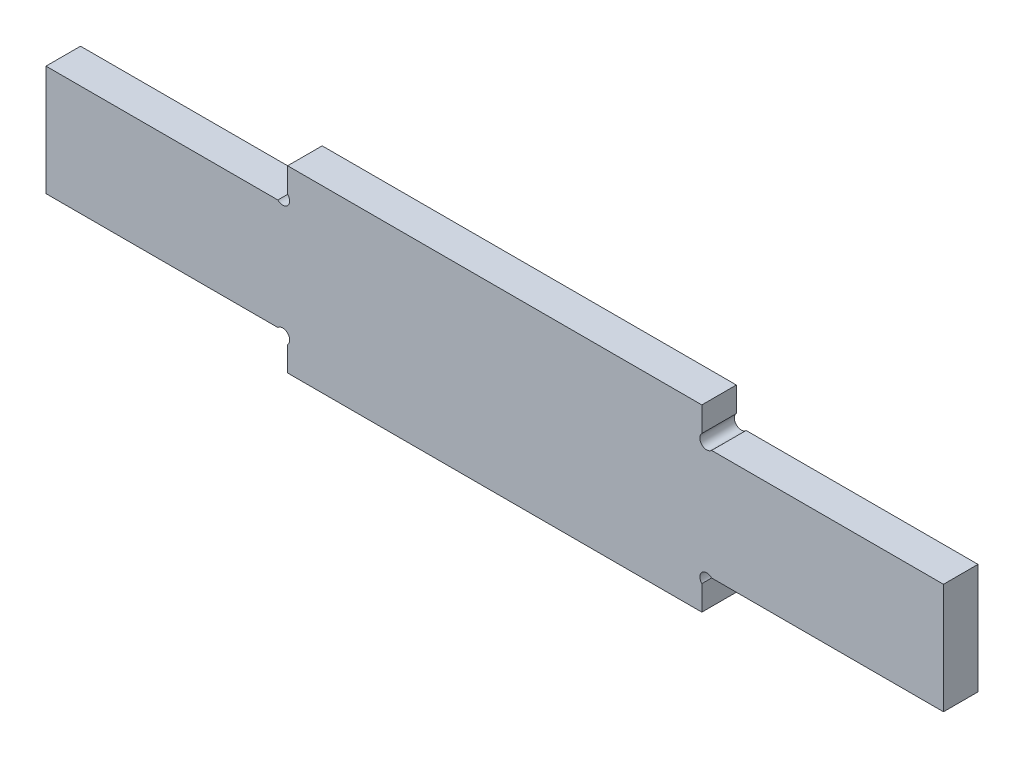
ISO-10303-21;
HEADER;
FILE_DESCRIPTION(('STEP AP214'),'2;1');
FILE_NAME('part.step','',(''),(''),'','','');
FILE_SCHEMA(('AUTOMOTIVE_DESIGN { 1 0 10303 214 1 1 1 1 }'));
ENDSEC;
DATA;
#1=APPLICATION_CONTEXT('core data for automotive mechanical design processes');
#2=APPLICATION_PROTOCOL_DEFINITION('international standard','automotive_design',2000,#1);
#3=PRODUCT_CONTEXT('',#1,'mechanical');
#4=PRODUCT('Part','Part','',(#3));
#5=PRODUCT_RELATED_PRODUCT_CATEGORY('part','',(#4));
#6=PRODUCT_DEFINITION_FORMATION('','',#4);
#7=PRODUCT_DEFINITION_CONTEXT('part definition',#1,'design');
#8=PRODUCT_DEFINITION('design','',#6,#7);
#9=PRODUCT_DEFINITION_SHAPE('','',#8);
#10=(LENGTH_UNIT() NAMED_UNIT(*) SI_UNIT(.MILLI.,.METRE.));
#11=(NAMED_UNIT(*) PLANE_ANGLE_UNIT() SI_UNIT($,.RADIAN.));
#12=(NAMED_UNIT(*) SI_UNIT($,.STERADIAN.) SOLID_ANGLE_UNIT());
#13=UNCERTAINTY_MEASURE_WITH_UNIT(LENGTH_MEASURE(1.E-05),#10,'distance_accuracy_value','');
#14=(GEOMETRIC_REPRESENTATION_CONTEXT(3) GLOBAL_UNCERTAINTY_ASSIGNED_CONTEXT((#13)) GLOBAL_UNIT_ASSIGNED_CONTEXT((#10,
#11,#12)) REPRESENTATION_CONTEXT('',''));
#15=CARTESIAN_POINT('',(0.,0.,0.));
#16=DIRECTION('',(0.,0.,1.));
#17=DIRECTION('',(1.,0.,0.));
#18=AXIS2_PLACEMENT_3D('',#15,#16,#17);
#19=CARTESIAN_POINT('',(0.,26.,5.));
#20=DIRECTION('',(0.,0.,-1.));
#21=DIRECTION('',(-1.,0.,0.));
#22=AXIS2_PLACEMENT_3D('',#19,#20,#21);
#23=PLANE('',#22);
#24=DIRECTION('',(0.,1.,0.));
#25=VECTOR('',#24,1.);
#26=CARTESIAN_POINT('',(95.,0.,5.));
#27=LINE('',#26,#25);
#28=CARTESIAN_POINT('',(95.,0.,5.));
#29=VERTEX_POINT('',#28);
#30=CARTESIAN_POINT('',(95.,3.5857864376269,5.));
#31=VERTEX_POINT('',#30);
#32=EDGE_CURVE('E54',#29,#31,#27,.T.);
#33=ORIENTED_EDGE('',*,*,#32,.T.);
#34=CARTESIAN_POINT('',(95.7071067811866,4.29289321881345,5.));
#35=DIRECTION('',(0.,0.,-1.));
#36=DIRECTION('',(-1.,0.,0.));
#37=AXIS2_PLACEMENT_3D('',#34,#35,#36);
#38=CIRCLE('',#37,0.999999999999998);
#39=CARTESIAN_POINT('',(96.4142135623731,5.,5.));
#40=VERTEX_POINT('',#39);
#41=EDGE_CURVE('E165',#31,#40,#38,.T.);
#42=ORIENTED_EDGE('',*,*,#41,.T.);
#43=DIRECTION('',(1.,0.,0.));
#44=VECTOR('',#43,1.);
#45=CARTESIAN_POINT('',(130.,5.,5.));
#46=LINE('',#45,#44);
#47=CARTESIAN_POINT('',(130.,5.,5.));
#48=VERTEX_POINT('',#47);
#49=EDGE_CURVE('E174',#40,#48,#46,.T.);
#50=ORIENTED_EDGE('',*,*,#49,.T.);
#51=DIRECTION('',(0.,-1.,0.));
#52=VECTOR('',#51,1.);
#53=CARTESIAN_POINT('',(130.,0.,5.));
#54=LINE('',#53,#52);
#55=CARTESIAN_POINT('',(130.,21.,5.));
#56=VERTEX_POINT('',#55);
#57=EDGE_CURVE('E202',#56,#48,#54,.T.);
#58=ORIENTED_EDGE('',*,*,#57,.F.);
#59=DIRECTION('',(-1.,0.,0.));
#60=VECTOR('',#59,1.);
#61=CARTESIAN_POINT('',(130.,21.,5.));
#62=LINE('',#61,#60);
#63=CARTESIAN_POINT('',(96.4142135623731,21.,5.));
#64=VERTEX_POINT('',#63);
#65=EDGE_CURVE('E62',#56,#64,#62,.T.);
#66=ORIENTED_EDGE('',*,*,#65,.T.);
#67=CARTESIAN_POINT('',(95.7071067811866,21.7071067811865,5.));
#68=DIRECTION('',(0.,0.,-1.));
#69=DIRECTION('',(-1.,0.,0.));
#70=AXIS2_PLACEMENT_3D('',#67,#68,#69);
#71=CIRCLE('',#70,0.999999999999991);
#72=CARTESIAN_POINT('',(95.,22.4142135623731,5.));
#73=VERTEX_POINT('',#72);
#74=EDGE_CURVE('E178',#64,#73,#71,.T.);
#75=ORIENTED_EDGE('',*,*,#74,.T.);
#76=DIRECTION('',(0.,1.,0.));
#77=VECTOR('',#76,1.);
#78=CARTESIAN_POINT('',(95.,26.,5.));
#79=LINE('',#78,#77);
#80=CARTESIAN_POINT('',(95.,26.,5.));
#81=VERTEX_POINT('',#80);
#82=EDGE_CURVE('E193',#73,#81,#79,.T.);
#83=ORIENTED_EDGE('',*,*,#82,.T.);
#84=DIRECTION('',(-1.,0.,0.));
#85=VECTOR('',#84,1.);
#86=CARTESIAN_POINT('',(0.,26.,5.));
#87=LINE('',#86,#85);
#88=CARTESIAN_POINT('',(35.,26.,5.));
#89=VERTEX_POINT('',#88);
#90=EDGE_CURVE('E11',#81,#89,#87,.T.);
#91=ORIENTED_EDGE('',*,*,#90,.T.);
#92=DIRECTION('',(0.,1.,0.));
#93=VECTOR('',#92,1.);
#94=CARTESIAN_POINT('',(35.,26.,5.));
#95=LINE('',#94,#93);
#96=CARTESIAN_POINT('',(35.,22.4142135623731,5.));
#97=VERTEX_POINT('',#96);
#98=EDGE_CURVE('E245',#97,#89,#95,.T.);
#99=ORIENTED_EDGE('',*,*,#98,.F.);
#100=CARTESIAN_POINT('',(34.2928932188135,21.7071067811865,5.));
#101=DIRECTION('',(0.,0.,1.));
#102=DIRECTION('',(1.,0.,0.));
#103=AXIS2_PLACEMENT_3D('',#100,#101,#102);
#104=CIRCLE('',#103,0.999999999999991);
#105=CARTESIAN_POINT('',(33.5857864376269,21.,5.));
#106=VERTEX_POINT('',#105);
#107=EDGE_CURVE('E220',#106,#97,#104,.T.);
#108=ORIENTED_EDGE('',*,*,#107,.F.);
#109=DIRECTION('',(1.,0.,0.));
#110=VECTOR('',#109,1.);
#111=CARTESIAN_POINT('',(0.,21.,5.));
#112=LINE('',#111,#110);
#113=CARTESIAN_POINT('',(0.,21.,5.));
#114=VERTEX_POINT('',#113);
#115=EDGE_CURVE('E242',#114,#106,#112,.T.);
#116=ORIENTED_EDGE('',*,*,#115,.F.);
#117=DIRECTION('',(0.,-1.,0.));
#118=VECTOR('',#117,1.);
#119=CARTESIAN_POINT('',(0.,0.,5.));
#120=LINE('',#119,#118);
#121=CARTESIAN_POINT('',(0.,5.,5.));
#122=VERTEX_POINT('',#121);
#123=EDGE_CURVE('E257',#114,#122,#120,.T.);
#124=ORIENTED_EDGE('',*,*,#123,.T.);
#125=DIRECTION('',(-1.,0.,0.));
#126=VECTOR('',#125,1.);
#127=CARTESIAN_POINT('',(0.,5.,5.));
#128=LINE('',#127,#126);
#129=CARTESIAN_POINT('',(33.5857864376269,5.,5.));
#130=VERTEX_POINT('',#129);
#131=EDGE_CURVE('E232',#130,#122,#128,.T.);
#132=ORIENTED_EDGE('',*,*,#131,.F.);
#133=CARTESIAN_POINT('',(34.2928932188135,4.29289321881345,5.));
#134=DIRECTION('',(0.,0.,1.));
#135=DIRECTION('',(1.,0.,0.));
#136=AXIS2_PLACEMENT_3D('',#133,#134,#135);
#137=CIRCLE('',#136,0.999999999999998);
#138=CARTESIAN_POINT('',(35.,3.58578643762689,5.));
#139=VERTEX_POINT('',#138);
#140=EDGE_CURVE('E214',#139,#130,#137,.T.);
#141=ORIENTED_EDGE('',*,*,#140,.F.);
#142=DIRECTION('',(0.,1.,0.));
#143=VECTOR('',#142,1.);
#144=CARTESIAN_POINT('',(35.,0.,5.));
#145=LINE('',#144,#143);
#146=CARTESIAN_POINT('',(35.,0.,5.));
#147=VERTEX_POINT('',#146);
#148=EDGE_CURVE('E229',#147,#139,#145,.T.);
#149=ORIENTED_EDGE('',*,*,#148,.F.);
#150=DIRECTION('',(1.,0.,0.));
#151=VECTOR('',#150,1.);
#152=CARTESIAN_POINT('',(0.,0.,5.));
#153=LINE('',#152,#151);
#154=EDGE_CURVE('E46',#147,#29,#153,.T.);
#155=ORIENTED_EDGE('',*,*,#154,.T.);
#156=EDGE_LOOP('',(#33,#42,#50,#58,#66,#75,#83,#91,#99,#108,#116,#124,#132,#141,#149,#155));
#157=FACE_BOUND('',#156,.T.);
#158=ADVANCED_FACE('F37',(#157),#23,.F.);
#159=CARTESIAN_POINT('',(0.,26.,0.));
#160=DIRECTION('',(0.,0.,-1.));
#161=DIRECTION('',(-1.,0.,0.));
#162=AXIS2_PLACEMENT_3D('',#159,#160,#161);
#163=PLANE('',#162);
#164=CARTESIAN_POINT('',(95.7071067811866,4.29289321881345,0.));
#165=DIRECTION('',(0.,0.,-1.));
#166=DIRECTION('',(-1.,0.,0.));
#167=AXIS2_PLACEMENT_3D('',#164,#165,#166);
#168=CIRCLE('',#167,0.999999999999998);
#169=CARTESIAN_POINT('',(95.,3.5857864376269,0.));
#170=VERTEX_POINT('',#169);
#171=CARTESIAN_POINT('',(96.4142135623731,5.,0.));
#172=VERTEX_POINT('',#171);
#173=EDGE_CURVE('E153',#170,#172,#168,.T.);
#174=ORIENTED_EDGE('',*,*,#173,.F.);
#175=DIRECTION('',(0.,1.,0.));
#176=VECTOR('',#175,1.);
#177=CARTESIAN_POINT('',(95.,0.,0.));
#178=LINE('',#177,#176);
#179=CARTESIAN_POINT('',(95.,0.,0.));
#180=VERTEX_POINT('',#179);
#181=EDGE_CURVE('E158',#180,#170,#178,.T.);
#182=ORIENTED_EDGE('',*,*,#181,.F.);
#183=DIRECTION('',(1.,0.,0.));
#184=VECTOR('',#183,1.);
#185=CARTESIAN_POINT('',(0.,0.,0.));
#186=LINE('',#185,#184);
#187=CARTESIAN_POINT('',(35.,0.,0.));
#188=VERTEX_POINT('',#187);
#189=EDGE_CURVE('E263',#188,#180,#186,.T.);
#190=ORIENTED_EDGE('',*,*,#189,.F.);
#191=DIRECTION('',(0.,1.,0.));
#192=VECTOR('',#191,1.);
#193=CARTESIAN_POINT('',(35.,0.,0.));
#194=LINE('',#193,#192);
#195=CARTESIAN_POINT('',(35.,3.58578643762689,0.));
#196=VERTEX_POINT('',#195);
#197=EDGE_CURVE('E224',#188,#196,#194,.T.);
#198=ORIENTED_EDGE('',*,*,#197,.T.);
#199=CARTESIAN_POINT('',(34.2928932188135,4.29289321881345,0.));
#200=DIRECTION('',(0.,0.,-1.));
#201=DIRECTION('',(-1.,0.,0.));
#202=AXIS2_PLACEMENT_3D('',#199,#200,#201);
#203=CIRCLE('',#202,0.999999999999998);
#204=CARTESIAN_POINT('',(33.5857864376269,5.,0.));
#205=VERTEX_POINT('',#204);
#206=EDGE_CURVE('E216',#196,#205,#203,.F.);
#207=ORIENTED_EDGE('',*,*,#206,.T.);
#208=DIRECTION('',(-1.,0.,0.));
#209=VECTOR('',#208,1.);
#210=CARTESIAN_POINT('',(0.,5.,0.));
#211=LINE('',#210,#209);
#212=CARTESIAN_POINT('',(0.,5.,0.));
#213=VERTEX_POINT('',#212);
#214=EDGE_CURVE('E227',#205,#213,#211,.T.);
#215=ORIENTED_EDGE('',*,*,#214,.T.);
#216=DIRECTION('',(0.,-1.,0.));
#217=VECTOR('',#216,1.);
#218=CARTESIAN_POINT('',(0.,0.,0.));
#219=LINE('',#218,#217);
#220=CARTESIAN_POINT('',(0.,21.,0.));
#221=VERTEX_POINT('',#220);
#222=EDGE_CURVE('E256',#221,#213,#219,.T.);
#223=ORIENTED_EDGE('',*,*,#222,.F.);
#224=DIRECTION('',(1.,0.,0.));
#225=VECTOR('',#224,1.);
#226=CARTESIAN_POINT('',(0.,21.,0.));
#227=LINE('',#226,#225);
#228=CARTESIAN_POINT('',(33.5857864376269,21.,0.));
#229=VERTEX_POINT('',#228);
#230=EDGE_CURVE('E252',#221,#229,#227,.T.);
#231=ORIENTED_EDGE('',*,*,#230,.T.);
#232=CARTESIAN_POINT('',(34.2928932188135,21.7071067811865,0.));
#233=DIRECTION('',(0.,0.,-1.));
#234=DIRECTION('',(-1.,0.,0.));
#235=AXIS2_PLACEMENT_3D('',#232,#233,#234);
#236=CIRCLE('',#235,0.999999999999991);
#237=CARTESIAN_POINT('',(35.,22.4142135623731,0.));
#238=VERTEX_POINT('',#237);
#239=EDGE_CURVE('E222',#229,#238,#236,.F.);
#240=ORIENTED_EDGE('',*,*,#239,.T.);
#241=DIRECTION('',(0.,1.,0.));
#242=VECTOR('',#241,1.);
#243=CARTESIAN_POINT('',(35.,26.,0.));
#244=LINE('',#243,#242);
#245=CARTESIAN_POINT('',(35.,26.,0.));
#246=VERTEX_POINT('',#245);
#247=EDGE_CURVE('E238',#238,#246,#244,.T.);
#248=ORIENTED_EDGE('',*,*,#247,.T.);
#249=DIRECTION('',(-1.,0.,0.));
#250=VECTOR('',#249,1.);
#251=CARTESIAN_POINT('',(0.,26.,0.));
#252=LINE('',#251,#250);
#253=CARTESIAN_POINT('',(95.,26.,0.));
#254=VERTEX_POINT('',#253);
#255=EDGE_CURVE('E41',#254,#246,#252,.T.);
#256=ORIENTED_EDGE('',*,*,#255,.F.);
#257=DIRECTION('',(0.,1.,0.));
#258=VECTOR('',#257,1.);
#259=CARTESIAN_POINT('',(95.,26.,0.));
#260=LINE('',#259,#258);
#261=CARTESIAN_POINT('',(95.,22.4142135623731,0.));
#262=VERTEX_POINT('',#261);
#263=EDGE_CURVE('E188',#262,#254,#260,.T.);
#264=ORIENTED_EDGE('',*,*,#263,.F.);
#265=CARTESIAN_POINT('',(95.7071067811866,21.7071067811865,0.));
#266=DIRECTION('',(0.,0.,-1.));
#267=DIRECTION('',(-1.,0.,0.));
#268=AXIS2_PLACEMENT_3D('',#265,#266,#267);
#269=CIRCLE('',#268,0.999999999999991);
#270=CARTESIAN_POINT('',(96.4142135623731,21.,0.));
#271=VERTEX_POINT('',#270);
#272=EDGE_CURVE('E175',#271,#262,#269,.T.);
#273=ORIENTED_EDGE('',*,*,#272,.F.);
#274=DIRECTION('',(-1.,0.,0.));
#275=VECTOR('',#274,1.);
#276=CARTESIAN_POINT('',(130.,21.,0.));
#277=LINE('',#276,#275);
#278=CARTESIAN_POINT('',(130.,21.,0.));
#279=VERTEX_POINT('',#278);
#280=EDGE_CURVE('E190',#279,#271,#277,.T.);
#281=ORIENTED_EDGE('',*,*,#280,.F.);
#282=DIRECTION('',(0.,-1.,0.));
#283=VECTOR('',#282,1.);
#284=CARTESIAN_POINT('',(130.,0.,0.));
#285=LINE('',#284,#283);
#286=CARTESIAN_POINT('',(130.,5.,0.));
#287=VERTEX_POINT('',#286);
#288=EDGE_CURVE('E199',#279,#287,#285,.T.);
#289=ORIENTED_EDGE('',*,*,#288,.T.);
#290=DIRECTION('',(1.,0.,0.));
#291=VECTOR('',#290,1.);
#292=CARTESIAN_POINT('',(130.,5.,0.));
#293=LINE('',#292,#291);
#294=EDGE_CURVE('E161',#172,#287,#293,.T.);
#295=ORIENTED_EDGE('',*,*,#294,.F.);
#296=EDGE_LOOP('',(#174,#182,#190,#198,#207,#215,#223,#231,#240,#248,#256,#264,#273,#281,#289,#295));
#297=FACE_BOUND('',#296,.T.);
#298=ADVANCED_FACE('F155',(#297),#163,.T.);
#299=CARTESIAN_POINT('',(95.,0.,-0.00100000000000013));
#300=DIRECTION('',(1.,0.,0.));
#301=DIRECTION('',(0.,0.,-1.));
#302=AXIS2_PLACEMENT_3D('',#299,#300,#301);
#303=PLANE('',#302);
#304=ORIENTED_EDGE('',*,*,#181,.T.);
#305=DIRECTION('',(0.,0.,1.));
#306=VECTOR('',#305,1.);
#307=CARTESIAN_POINT('',(95.,3.5857864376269,-0.00100000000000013));
#308=LINE('',#307,#306);
#309=EDGE_CURVE('E167',#31,#170,#308,.F.);
#310=ORIENTED_EDGE('',*,*,#309,.F.);
#311=ORIENTED_EDGE('',*,*,#32,.F.);
#312=DIRECTION('',(0.,0.,1.));
#313=VECTOR('',#312,1.);
#314=CARTESIAN_POINT('',(95.,0.,-0.00100000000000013));
#315=LINE('',#314,#313);
#316=EDGE_CURVE('E173',#180,#29,#315,.T.);
#317=ORIENTED_EDGE('',*,*,#316,.F.);
#318=EDGE_LOOP('',(#304,#310,#311,#317));
#319=FACE_BOUND('',#318,.T.);
#320=ADVANCED_FACE('F172',(#319),#303,.T.);
#321=CARTESIAN_POINT('',(130.,21.,-0.00100000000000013));
#322=DIRECTION('',(0.,1.,0.));
#323=DIRECTION('',(0.,0.,1.));
#324=AXIS2_PLACEMENT_3D('',#321,#322,#323);
#325=PLANE('',#324);
#326=ORIENTED_EDGE('',*,*,#280,.T.);
#327=DIRECTION('',(0.,0.,1.));
#328=VECTOR('',#327,1.);
#329=CARTESIAN_POINT('',(96.4142135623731,21.,-0.00100000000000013));
#330=LINE('',#329,#328);
#331=EDGE_CURVE('E170',#64,#271,#330,.F.);
#332=ORIENTED_EDGE('',*,*,#331,.F.);
#333=ORIENTED_EDGE('',*,*,#65,.F.);
#334=DIRECTION('',(0.,0.,1.));
#335=VECTOR('',#334,1.);
#336=CARTESIAN_POINT('',(130.,21.,-0.00100000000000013));
#337=LINE('',#336,#335);
#338=EDGE_CURVE('E197',#279,#56,#337,.T.);
#339=ORIENTED_EDGE('',*,*,#338,.F.);
#340=EDGE_LOOP('',(#326,#332,#333,#339));
#341=FACE_BOUND('',#340,.T.);
#342=ADVANCED_FACE('F293',(#341),#325,.T.);
#343=CARTESIAN_POINT('',(130.,5.,-0.00100000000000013));
#344=DIRECTION('',(0.,-1.,0.));
#345=DIRECTION('',(0.,0.,-1.));
#346=AXIS2_PLACEMENT_3D('',#343,#344,#345);
#347=PLANE('',#346);
#348=ORIENTED_EDGE('',*,*,#49,.F.);
#349=DIRECTION('',(0.,0.,1.));
#350=VECTOR('',#349,1.);
#351=CARTESIAN_POINT('',(96.4142135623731,5.,-0.00100000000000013));
#352=LINE('',#351,#350);
#353=EDGE_CURVE('E291',#172,#40,#352,.T.);
#354=ORIENTED_EDGE('',*,*,#353,.F.);
#355=ORIENTED_EDGE('',*,*,#294,.T.);
#356=DIRECTION('',(0.,0.,1.));
#357=VECTOR('',#356,1.);
#358=CARTESIAN_POINT('',(130.,5.,-0.00100000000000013));
#359=LINE('',#358,#357);
#360=EDGE_CURVE('E183',#287,#48,#359,.T.);
#361=ORIENTED_EDGE('',*,*,#360,.T.);
#362=EDGE_LOOP('',(#348,#354,#355,#361));
#363=FACE_BOUND('',#362,.T.);
#364=ADVANCED_FACE('F300',(#363),#347,.T.);
#365=CARTESIAN_POINT('',(95.,26.,-0.00100000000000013));
#366=DIRECTION('',(1.,0.,0.));
#367=DIRECTION('',(0.,0.,-1.));
#368=AXIS2_PLACEMENT_3D('',#365,#366,#367);
#369=PLANE('',#368);
#370=ORIENTED_EDGE('',*,*,#82,.F.);
#371=DIRECTION('',(0.,0.,1.));
#372=VECTOR('',#371,1.);
#373=CARTESIAN_POINT('',(95.,22.4142135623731,-0.00100000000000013));
#374=LINE('',#373,#372);
#375=EDGE_CURVE('E164',#262,#73,#374,.T.);
#376=ORIENTED_EDGE('',*,*,#375,.F.);
#377=ORIENTED_EDGE('',*,*,#263,.T.);
#378=DIRECTION('',(0.,0.,1.));
#379=VECTOR('',#378,1.);
#380=CARTESIAN_POINT('',(95.,26.,-0.00100000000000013));
#381=LINE('',#380,#379);
#382=EDGE_CURVE('E196',#254,#81,#381,.T.);
#383=ORIENTED_EDGE('',*,*,#382,.T.);
#384=EDGE_LOOP('',(#370,#376,#377,#383));
#385=FACE_BOUND('',#384,.T.);
#386=ADVANCED_FACE('F285',(#385),#369,.T.);
#387=CARTESIAN_POINT('',(130.,0.,5.));
#388=DIRECTION('',(1.,0.,0.));
#389=DIRECTION('',(0.,0.,-1.));
#390=AXIS2_PLACEMENT_3D('',#387,#388,#389);
#391=PLANE('',#390);
#392=ORIENTED_EDGE('',*,*,#57,.T.);
#393=ORIENTED_EDGE('',*,*,#360,.F.);
#394=ORIENTED_EDGE('',*,*,#288,.F.);
#395=ORIENTED_EDGE('',*,*,#338,.T.);
#396=EDGE_LOOP('',(#392,#393,#394,#395));
#397=FACE_BOUND('',#396,.T.);
#398=ADVANCED_FACE('F296',(#397),#391,.T.);
#399=CARTESIAN_POINT('',(0.,0.,5.));
#400=DIRECTION('',(0.,1.,0.));
#401=DIRECTION('',(0.,0.,1.));
#402=AXIS2_PLACEMENT_3D('',#399,#400,#401);
#403=PLANE('',#402);
#404=ORIENTED_EDGE('',*,*,#316,.T.);
#405=ORIENTED_EDGE('',*,*,#154,.F.);
#406=DIRECTION('',(0.,0.,1.));
#407=VECTOR('',#406,1.);
#408=CARTESIAN_POINT('',(35.,0.,-0.00100000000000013));
#409=LINE('',#408,#407);
#410=EDGE_CURVE('E234',#188,#147,#409,.T.);
#411=ORIENTED_EDGE('',*,*,#410,.F.);
#412=ORIENTED_EDGE('',*,*,#189,.T.);
#413=EDGE_LOOP('',(#404,#405,#411,#412));
#414=FACE_BOUND('',#413,.T.);
#415=ADVANCED_FACE('F324',(#414),#403,.F.);
#416=CARTESIAN_POINT('',(0.,26.,5.));
#417=DIRECTION('',(0.,-1.,0.));
#418=DIRECTION('',(0.,0.,-1.));
#419=AXIS2_PLACEMENT_3D('',#416,#417,#418);
#420=PLANE('',#419);
#421=ORIENTED_EDGE('',*,*,#382,.F.);
#422=ORIENTED_EDGE('',*,*,#255,.T.);
#423=DIRECTION('',(0.,0.,1.));
#424=VECTOR('',#423,1.);
#425=CARTESIAN_POINT('',(35.,26.,-0.00100000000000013));
#426=LINE('',#425,#424);
#427=EDGE_CURVE('E249',#246,#89,#426,.T.);
#428=ORIENTED_EDGE('',*,*,#427,.T.);
#429=ORIENTED_EDGE('',*,*,#90,.F.);
#430=EDGE_LOOP('',(#421,#422,#428,#429));
#431=FACE_BOUND('',#430,.T.);
#432=ADVANCED_FACE('F269',(#431),#420,.F.);
#433=CARTESIAN_POINT('',(0.,0.,5.));
#434=DIRECTION('',(1.,0.,0.));
#435=DIRECTION('',(0.,0.,-1.));
#436=AXIS2_PLACEMENT_3D('',#433,#434,#435);
#437=PLANE('',#436);
#438=ORIENTED_EDGE('',*,*,#222,.T.);
#439=DIRECTION('',(0.,0.,1.));
#440=VECTOR('',#439,1.);
#441=CARTESIAN_POINT('',(0.,5.,-0.00100000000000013));
#442=LINE('',#441,#440);
#443=EDGE_CURVE('E235',#213,#122,#442,.T.);
#444=ORIENTED_EDGE('',*,*,#443,.T.);
#445=ORIENTED_EDGE('',*,*,#123,.F.);
#446=DIRECTION('',(0.,0.,1.));
#447=VECTOR('',#446,1.);
#448=CARTESIAN_POINT('',(0.,21.,-0.00100000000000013));
#449=LINE('',#448,#447);
#450=EDGE_CURVE('E248',#221,#114,#449,.T.);
#451=ORIENTED_EDGE('',*,*,#450,.F.);
#452=EDGE_LOOP('',(#438,#444,#445,#451));
#453=FACE_BOUND('',#452,.T.);
#454=ADVANCED_FACE('F39',(#453),#437,.F.);
#455=CARTESIAN_POINT('',(35.,26.,-0.00100000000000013));
#456=DIRECTION('',(1.,0.,0.));
#457=DIRECTION('',(0.,0.,-1.));
#458=AXIS2_PLACEMENT_3D('',#455,#456,#457);
#459=PLANE('',#458);
#460=ORIENTED_EDGE('',*,*,#247,.F.);
#461=DIRECTION('',(0.,0.,1.));
#462=VECTOR('',#461,1.);
#463=CARTESIAN_POINT('',(35.,22.4142135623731,-0.00100000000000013));
#464=LINE('',#463,#462);
#465=EDGE_CURVE('E209',#97,#238,#464,.F.);
#466=ORIENTED_EDGE('',*,*,#465,.F.);
#467=ORIENTED_EDGE('',*,*,#98,.T.);
#468=ORIENTED_EDGE('',*,*,#427,.F.);
#469=EDGE_LOOP('',(#460,#466,#467,#468));
#470=FACE_BOUND('',#469,.T.);
#471=ADVANCED_FACE('F276',(#470),#459,.F.);
#472=CARTESIAN_POINT('',(0.,21.,-0.00100000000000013));
#473=DIRECTION('',(0.,-1.,0.));
#474=DIRECTION('',(0.,0.,-1.));
#475=AXIS2_PLACEMENT_3D('',#472,#473,#474);
#476=PLANE('',#475);
#477=ORIENTED_EDGE('',*,*,#115,.T.);
#478=DIRECTION('',(0.,0.,1.));
#479=VECTOR('',#478,1.);
#480=CARTESIAN_POINT('',(33.5857864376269,21.,-0.00100000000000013));
#481=LINE('',#480,#479);
#482=EDGE_CURVE('E218',#229,#106,#481,.T.);
#483=ORIENTED_EDGE('',*,*,#482,.F.);
#484=ORIENTED_EDGE('',*,*,#230,.F.);
#485=ORIENTED_EDGE('',*,*,#450,.T.);
#486=EDGE_LOOP('',(#477,#483,#484,#485));
#487=FACE_BOUND('',#486,.T.);
#488=ADVANCED_FACE('F320',(#487),#476,.F.);
#489=CARTESIAN_POINT('',(0.,5.,-0.00100000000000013));
#490=DIRECTION('',(0.,1.,0.));
#491=DIRECTION('',(0.,0.,1.));
#492=AXIS2_PLACEMENT_3D('',#489,#490,#491);
#493=PLANE('',#492);
#494=ORIENTED_EDGE('',*,*,#214,.F.);
#495=DIRECTION('',(0.,0.,1.));
#496=VECTOR('',#495,1.);
#497=CARTESIAN_POINT('',(33.5857864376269,5.,-0.00100000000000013));
#498=LINE('',#497,#496);
#499=EDGE_CURVE('E205',#130,#205,#498,.F.);
#500=ORIENTED_EDGE('',*,*,#499,.F.);
#501=ORIENTED_EDGE('',*,*,#131,.T.);
#502=ORIENTED_EDGE('',*,*,#443,.F.);
#503=EDGE_LOOP('',(#494,#500,#501,#502));
#504=FACE_BOUND('',#503,.T.);
#505=ADVANCED_FACE('F344',(#504),#493,.F.);
#506=CARTESIAN_POINT('',(35.,0.,-0.00100000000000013));
#507=DIRECTION('',(1.,0.,0.));
#508=DIRECTION('',(0.,0.,-1.));
#509=AXIS2_PLACEMENT_3D('',#506,#507,#508);
#510=PLANE('',#509);
#511=ORIENTED_EDGE('',*,*,#148,.T.);
#512=DIRECTION('',(0.,0.,1.));
#513=VECTOR('',#512,1.);
#514=CARTESIAN_POINT('',(35.,3.58578643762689,-0.00100000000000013));
#515=LINE('',#514,#513);
#516=EDGE_CURVE('E212',#196,#139,#515,.T.);
#517=ORIENTED_EDGE('',*,*,#516,.F.);
#518=ORIENTED_EDGE('',*,*,#197,.F.);
#519=ORIENTED_EDGE('',*,*,#410,.T.);
#520=EDGE_LOOP('',(#511,#517,#518,#519));
#521=FACE_BOUND('',#520,.T.);
#522=ADVANCED_FACE('F336',(#521),#510,.F.);
#523=CARTESIAN_POINT('',(34.2928932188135,21.7071067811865,-0.00100000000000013));
#524=DIRECTION('',(0.,0.,1.));
#525=DIRECTION('',(1.,0.,0.));
#526=AXIS2_PLACEMENT_3D('',#523,#524,#525);
#527=CYLINDRICAL_SURFACE('',#526,0.999999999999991);
#528=ORIENTED_EDGE('',*,*,#107,.T.);
#529=ORIENTED_EDGE('',*,*,#465,.T.);
#530=ORIENTED_EDGE('',*,*,#239,.F.);
#531=ORIENTED_EDGE('',*,*,#482,.T.);
#532=EDGE_LOOP('',(#528,#529,#530,#531));
#533=FACE_BOUND('',#532,.T.);
#534=ADVANCED_FACE('F351',(#533),#527,.F.);
#535=CARTESIAN_POINT('',(34.2928932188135,4.29289321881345,-0.00100000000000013));
#536=DIRECTION('',(0.,0.,1.));
#537=DIRECTION('',(1.,0.,0.));
#538=AXIS2_PLACEMENT_3D('',#535,#536,#537);
#539=CYLINDRICAL_SURFACE('',#538,0.999999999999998);
#540=ORIENTED_EDGE('',*,*,#140,.T.);
#541=ORIENTED_EDGE('',*,*,#499,.T.);
#542=ORIENTED_EDGE('',*,*,#206,.F.);
#543=ORIENTED_EDGE('',*,*,#516,.T.);
#544=EDGE_LOOP('',(#540,#541,#542,#543));
#545=FACE_BOUND('',#544,.T.);
#546=ADVANCED_FACE('F342',(#545),#539,.F.);
#547=CARTESIAN_POINT('',(95.7071067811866,21.7071067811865,-0.00100000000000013));
#548=DIRECTION('',(0.,0.,1.));
#549=DIRECTION('',(1.,0.,0.));
#550=AXIS2_PLACEMENT_3D('',#547,#548,#549);
#551=CYLINDRICAL_SURFACE('',#550,0.999999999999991);
#552=ORIENTED_EDGE('',*,*,#375,.T.);
#553=ORIENTED_EDGE('',*,*,#74,.F.);
#554=ORIENTED_EDGE('',*,*,#331,.T.);
#555=ORIENTED_EDGE('',*,*,#272,.T.);
#556=EDGE_LOOP('',(#552,#553,#554,#555));
#557=FACE_BOUND('',#556,.T.);
#558=ADVANCED_FACE('F290',(#557),#551,.F.);
#559=CARTESIAN_POINT('',(95.7071067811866,4.29289321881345,-0.00100000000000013));
#560=DIRECTION('',(0.,0.,1.));
#561=DIRECTION('',(1.,0.,0.));
#562=AXIS2_PLACEMENT_3D('',#559,#560,#561);
#563=CYLINDRICAL_SURFACE('',#562,0.999999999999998);
#564=ORIENTED_EDGE('',*,*,#173,.T.);
#565=ORIENTED_EDGE('',*,*,#353,.T.);
#566=ORIENTED_EDGE('',*,*,#41,.F.);
#567=ORIENTED_EDGE('',*,*,#309,.T.);
#568=EDGE_LOOP('',(#564,#565,#566,#567));
#569=FACE_BOUND('',#568,.T.);
#570=ADVANCED_FACE('F168',(#569),#563,.F.);
#571=CLOSED_SHELL('',(#158,#298,#320,#342,#364,#386,#398,#415,#432,#454,#471,#488,#505,#522,
#534,#546,#558,#570));
#572=MANIFOLD_SOLID_BREP('B2',#571);
#573=ADVANCED_BREP_SHAPE_REPRESENTATION('',(#18,#572),#14);
#574=SHAPE_DEFINITION_REPRESENTATION(#9,#573);
ENDSEC;
END-ISO-10303-21;
